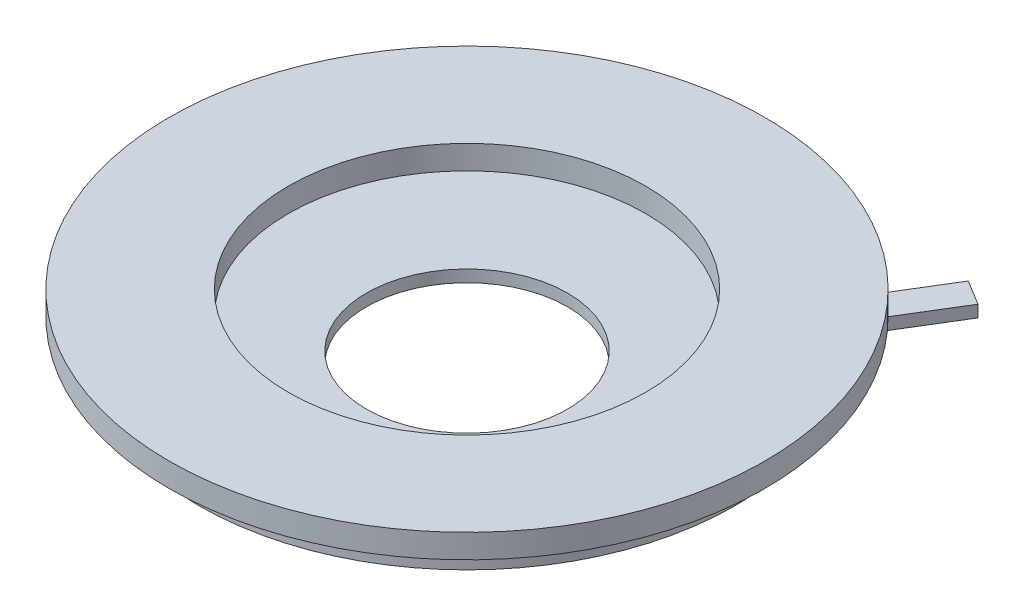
from build123d import *

# Parameters (mm, degrees)
ESQUISSE1_R      = 25
ESQUISSE1_R_2    = 15
EXTRUSION1_DEPTH = 2
ESQUISSE2_R      = 22.5
ESQUISSE2_R_2    = 20
EXTRUSION2_DEPTH = 2.5
ESQUISSE3_R      = 8.444444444
EXTRUSION3_DEPTH = 1


with BuildPart() as part:
    # Esquisse1 → Extrusion1 (new body)
    with BuildSketch(Plane(origin=(0, 0, 0), x_dir=(1, 0, 0), z_dir=(0, 1, 0))):
        with Locations(Location((0, 0, 0), (0, 0, 270))):
            Circle(ESQUISSE1_R)
        with Locations(Location((0, 0, 0), (0, 0, 270))):
            Circle(ESQUISSE1_R_2, mode=Mode.SUBTRACT)
    extrude(amount=EXTRUSION1_DEPTH)

    # Esquisse2 → Extrusion2 (add)
    with BuildSketch(Plane.XZ):
        with Locations(Location((0, 0, 0), (0, 0, 90))):
            Circle(ESQUISSE2_R)
        with Locations(Location((0, 0, 0), (0, 0, 270))):
            Circle(ESQUISSE2_R_2, mode=Mode.SUBTRACT)
    extrude(amount=EXTRUSION2_DEPTH)


with BuildPart() as body_2:
    # Esquisse3 → Extrusion3 (new body)
    with BuildSketch(Plane.XZ.offset(2.5)):
        with BuildLine():
            Line((10.414532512, -17.074469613), (15.944192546, -26.140264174))
            Line((15.944192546, -26.140264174), (18.038378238, -24.862920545))
            Line((18.038378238, -24.862920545), (12.430088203, -15.668213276))
            ThreePointArc((12.430088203, -15.668213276), (-11.443931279, 16.402330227), (10.414532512, -17.074469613))
        make_face()
        with Locations(Location((0, 0, 0), (0, 0, 270))):
            Circle(ESQUISSE3_R, mode=Mode.SUBTRACT)
    extrude(amount=EXTRUSION3_DEPTH)


solid = Compound([part.part, body_2.part])
